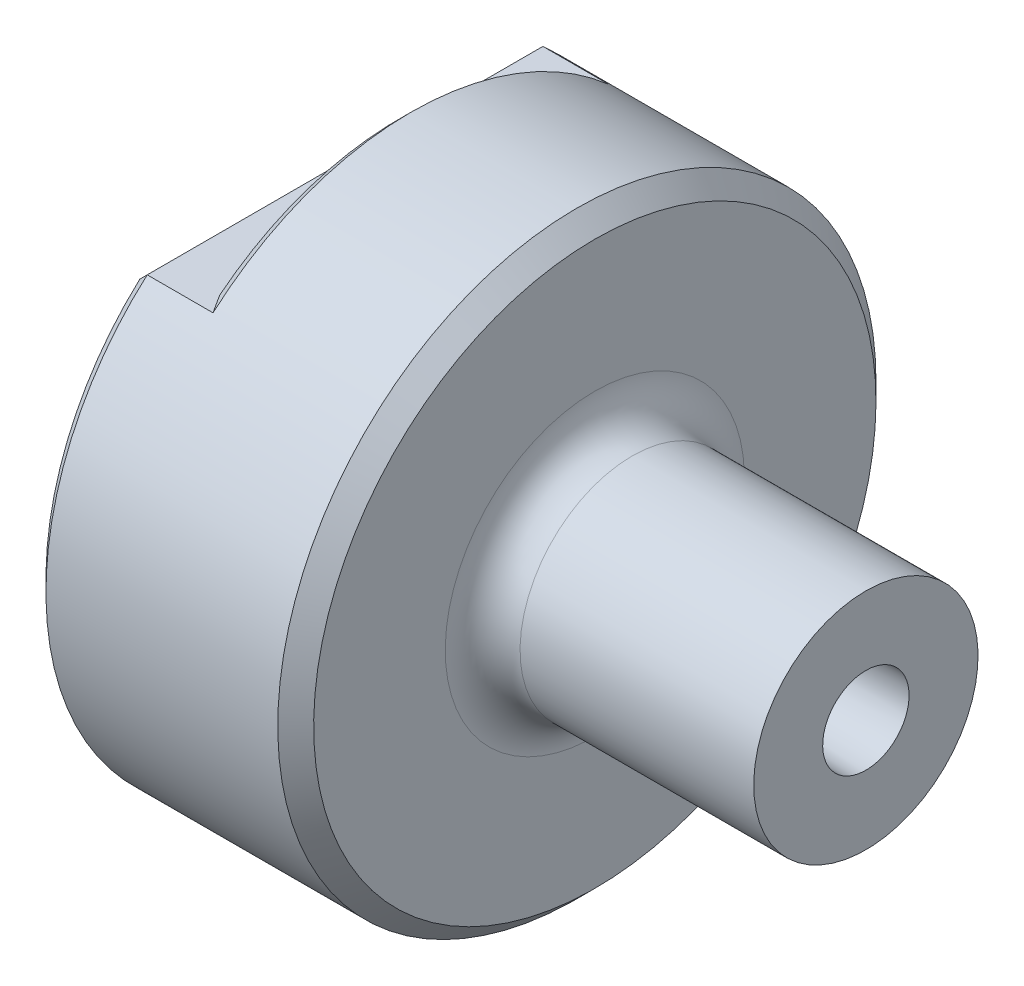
from build123d import *

# Parameters (mm, degrees)
SKETCH1_R           = 25.4
BOSS_EXTRUDE1_DEPTH = 22.621875
SKETCH3_W           = 50.8
SKETCH3_H           = 6.35
CUT_EXTRUDE1_DEPTH  = 5.588
SKETCH5_W           = 23.01875
SKETCH5_H           = 15.875
FILLET1_R           = 3.175
CHAMFER1_SIZE       = 1.524
CHAMFER2_SIZE       = 1.016


with BuildPart() as part:
    # Sketch1 → Boss-Extrude1 (new, symmetric)
    with BuildSketch(Plane(origin=(0, 0, 0), x_dir=(0, 0, -1), z_dir=(1, 0, 0))):
        Circle(SKETCH1_R)
    extrude(amount=BOSS_EXTRUDE1_DEPTH, both=True)

    # Sketch3 → Cut-Extrude1 (cut)
    with BuildSketch(Plane.ZY.offset(22.621875)):
        with Locations((0, 22.225)):
            Rectangle(SKETCH3_W, SKETCH3_H)
    extrude(amount=-CUT_EXTRUDE1_DEPTH, mode=Mode.SUBTRACT)

    # Sketch5 → Cut-Revolve1 (revolve, cut)
    with BuildSketch(Plane.XY, mode=Mode.PRIVATE) as cut_revolve1_sk:
        with Locations((11.1125, -17.4625)):
            Rectangle(SKETCH5_W, SKETCH5_H)
    revolve(cut_revolve1_sk.sketch.rotate(Axis((22.621875, 0, 0), (-1, 0, 0)), 138.590377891), axis=Axis((22.621875, 0, 0), (-1, 0, 0)), mode=Mode.SUBTRACT)

    # Sketch6 → Cut-Revolve2 (revolve, cut)
    with BuildSketch(Plane.XY):
        with BuildLine():
            Line((-17.999075, 0), (-22.621875, 0))
            Line((-22.621875, 0), (-22.621875, 12.440192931))
            ThreePointArc((-22.621875, 12.440192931), (-19.192134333, 6.635674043), (-17.999075, 0))
        make_face()
    revolve(axis=Axis((22.621875, 0, 0), (-1, 0, 0)), mode=Mode.SUBTRACT)

    # Sketch7 → Cut-Revolve3 (revolve, cut)
    with BuildSketch(Plane.XY):
        Polygon((-18.202735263, 2.778125), (22.621875, 3.668921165), (22.621875, 0), (-18.202735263, 0), align=None)
    revolve(axis=Axis((22.621875, 0, 0), (-1, 0, 0)), mode=Mode.SUBTRACT)

    # Fillet1
    fillet1_edges = [part.edges().sort_by_distance(p)[0] for p in [
        (-0.396875, -7.14375, -6.300195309),
    ]]
    fillet(fillet1_edges, radius=FILLET1_R)

    # Chamfer1
    chamfer1_edges = [part.edges().sort_by_distance(p)[0] for p in [
        (-0.396875, 0, 25.4),
    ]]
    chamfer(chamfer1_edges, length=CHAMFER1_SIZE)

    # Chamfer2
    chamfer2_edges = [part.edges().sort_by_distance(p)[0] for p in [
        (-22.621875, -23.150520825, 10.450520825),
        (-22.621875, 19.05, 0),
        (-17.033875, 25.4, 0),
    ]]
    chamfer(chamfer2_edges, length=CHAMFER2_SIZE)


solid = part.part
